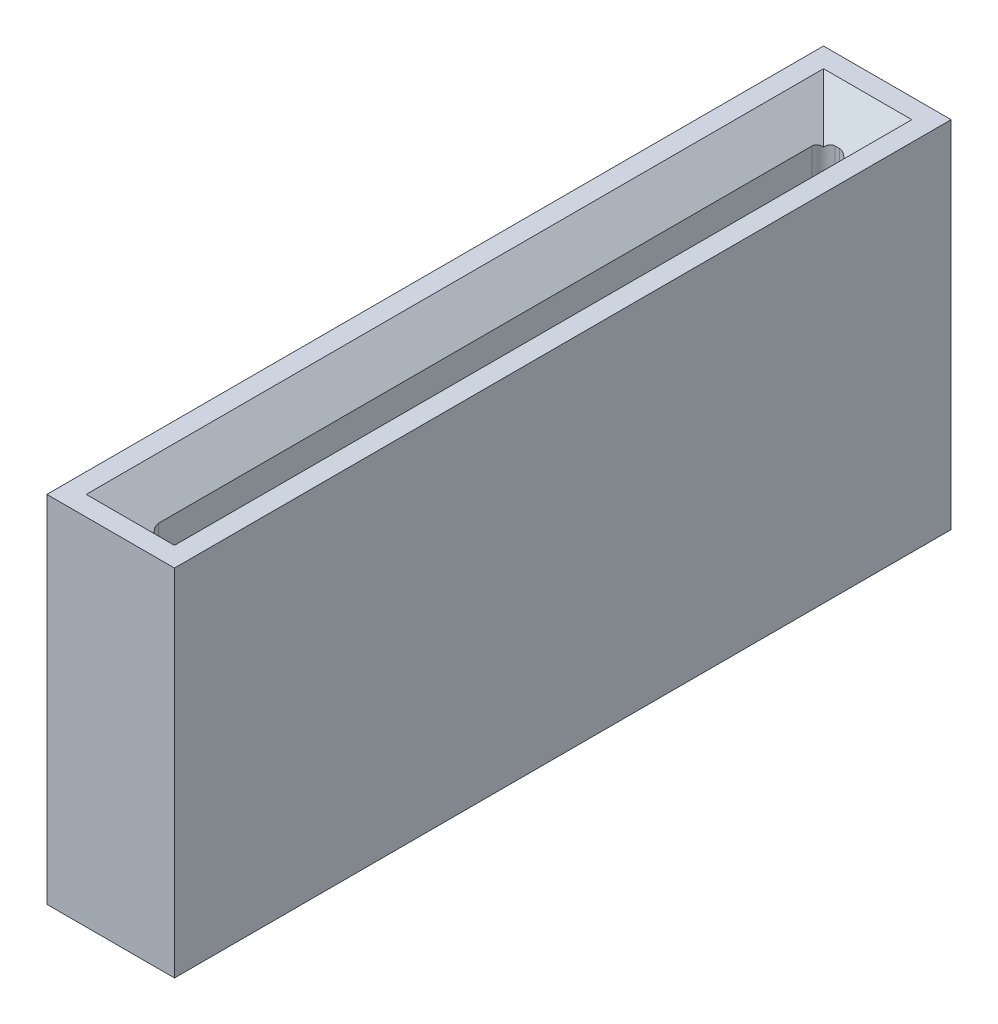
from build123d import *

# Parameters (mm, degrees)
SK_BLOCK_W          = 146.05
SK_BLOCK_H          = 889
SK_BLOCK_W_2        = 31.05
SK_BLOCK_H_2        = 774
BOSS_EXTRUDE1_DEPTH = 203.2
CHAMFER1_SIZE       = 35
FILLET1_R           = 13


with BuildPart() as part:
    # sk block → Boss-Extrude1 (new, symmetric)
    with BuildSketch(Plane(origin=(0, 0, 0), x_dir=(-1, 0, 0), z_dir=(0, 1, 0))):
        Rectangle(SK_BLOCK_W, SK_BLOCK_H)
        Rectangle(SK_BLOCK_W_2, SK_BLOCK_H_2, mode=Mode.SUBTRACT)
    extrude(amount=BOSS_EXTRUDE1_DEPTH, both=True)

    # Chamfer1
    chamfer1_edges = [part.edges().sort_by_distance(p)[0] for p in [
        (0, -203.2, 387),
        (15.525, -203.2, 0),
        (0, -203.2, -387),
        (-15.525, -203.2, 0),
        (0, 203.2, 387),
        (15.525, 203.2, 0),
        (0, 203.2, -387),
        (-15.525, 203.2, 0),
    ]]
    chamfer(chamfer1_edges, length=CHAMFER1_SIZE)

    # Fillet1
    fillet1_edges = [part.edges().sort_by_distance(p)[0] for p in [
        (-15.525, 0, 387),
        (15.525, 0, 387),
        (-15.525, 0, -387),
        (15.525, 0, -387),
    ]]
    fillet(fillet1_edges, radius=FILLET1_R)


solid = part.part
